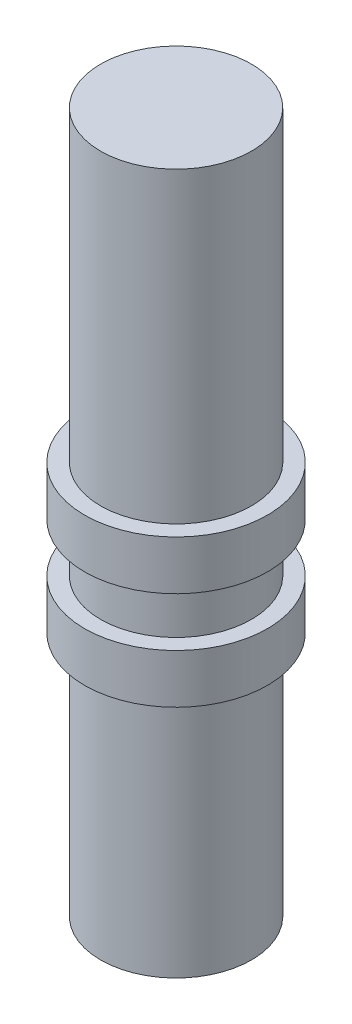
from build123d import *

# Parameters (mm, degrees)
SKETCH2_R           = 3.8989
BOSS_EXTRUDE1_DEPTH = 12.7
SKETCH3_R           = 4.7244
BOSS_EXTRUDE2_DEPTH = 2.54
SKETCH4_R           = 3.8989
BOSS_EXTRUDE3_DEPTH = 2.54
SKETCH5_R           = 4.7244
BOSS_EXTRUDE4_DEPTH = 2.54
SKETCH6_R           = 3.8989
BOSS_EXTRUDE5_DEPTH = 15.875
SKETCH7_R           = 3.175
CUT_EXTRUDE1_DEPTH  = 6.35


with BuildPart() as part:
    # Sketch2 → Boss-Extrude1 (new body)
    with BuildSketch(Plane(origin=(0, 0, 0), x_dir=(1, 0, 0), z_dir=(0, 1, 0))):
        with Locations(Location((0, 0, 0), (0, 0, 270))):
            Circle(SKETCH2_R)
    extrude(amount=BOSS_EXTRUDE1_DEPTH)

    # Sketch3 → Boss-Extrude2 (add)
    with BuildSketch(Plane(origin=(0, 12.7, 0), x_dir=(1, 0, 0), z_dir=(0, 1, 0))):
        with Locations(Location((0, 0, 0), (0, 0, 270))):
            Circle(SKETCH3_R)
    extrude(amount=BOSS_EXTRUDE2_DEPTH)

    # Sketch4 → Boss-Extrude3 (add)
    with BuildSketch(Plane(origin=(0, 15.24, 0), x_dir=(1, 0, 0), z_dir=(0, 1, 0))):
        with Locations(Location((0, 0, 0), (0, 0, 270))):
            Circle(SKETCH4_R)
    extrude(amount=BOSS_EXTRUDE3_DEPTH)

    # Sketch5 → Boss-Extrude4 (add)
    with BuildSketch(Plane(origin=(0, 17.78, 0), x_dir=(1, 0, 0), z_dir=(0, 1, 0))):
        with Locations(Location((0, 0, 0), (0, 0, 270))):
            Circle(SKETCH5_R)
    extrude(amount=BOSS_EXTRUDE4_DEPTH)

    # Sketch6 → Boss-Extrude5 (add)
    with BuildSketch(Plane(origin=(0, 20.32, 0), x_dir=(-1, 0, 0), z_dir=(0, 1, 0))):
        with Locations(Location((0, 0, 0), (0, 0, 90))):
            Circle(SKETCH6_R)
    extrude(amount=BOSS_EXTRUDE5_DEPTH)

    # Sketch7 → Cut-Extrude1 (cut)
    with BuildSketch(Plane.XZ):
        with Locations(Location((0, 0, 0), (0, 0, 270))):
            Circle(SKETCH7_R)
    extrude(amount=-CUT_EXTRUDE1_DEPTH, mode=Mode.SUBTRACT)


solid = part.part
